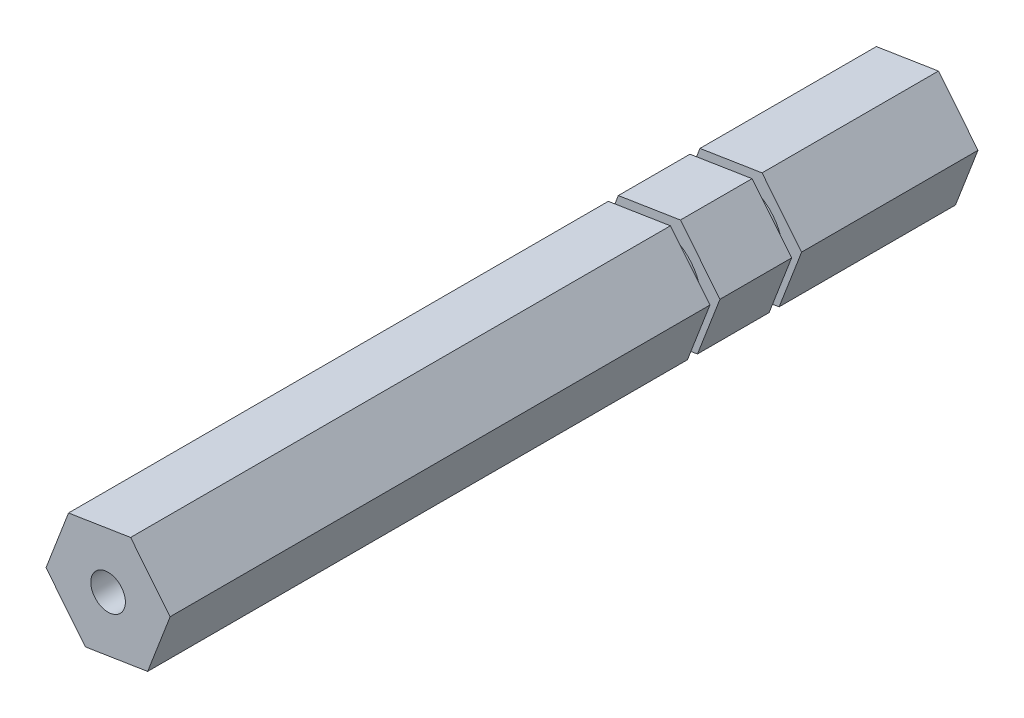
ISO-10303-21;
HEADER;
FILE_DESCRIPTION(('STEP AP214'),'2;1');
FILE_NAME('part.step','',(''),(''),'','','');
FILE_SCHEMA(('AUTOMOTIVE_DESIGN { 1 0 10303 214 1 1 1 1 }'));
ENDSEC;
DATA;
#1=APPLICATION_CONTEXT('core data for automotive mechanical design processes');
#2=APPLICATION_PROTOCOL_DEFINITION('international standard','automotive_design',2000,#1);
#3=PRODUCT_CONTEXT('',#1,'mechanical');
#4=PRODUCT('Part','Part','',(#3));
#5=PRODUCT_RELATED_PRODUCT_CATEGORY('part','',(#4));
#6=PRODUCT_DEFINITION_FORMATION('','',#4);
#7=PRODUCT_DEFINITION_CONTEXT('part definition',#1,'design');
#8=PRODUCT_DEFINITION('design','',#6,#7);
#9=PRODUCT_DEFINITION_SHAPE('','',#8);
#10=(LENGTH_UNIT() NAMED_UNIT(*) SI_UNIT(.MILLI.,.METRE.));
#11=(NAMED_UNIT(*) PLANE_ANGLE_UNIT() SI_UNIT($,.RADIAN.));
#12=(NAMED_UNIT(*) SI_UNIT($,.STERADIAN.) SOLID_ANGLE_UNIT());
#13=UNCERTAINTY_MEASURE_WITH_UNIT(LENGTH_MEASURE(1.E-05),#10,'distance_accuracy_value','');
#14=(GEOMETRIC_REPRESENTATION_CONTEXT(3) GLOBAL_UNCERTAINTY_ASSIGNED_CONTEXT((#13)) GLOBAL_UNIT_ASSIGNED_CONTEXT((#10,
#11,#12)) REPRESENTATION_CONTEXT('',''));
#15=CARTESIAN_POINT('',(0.,0.,0.));
#16=DIRECTION('',(0.,0.,1.));
#17=DIRECTION('',(1.,0.,0.));
#18=AXIS2_PLACEMENT_3D('',#15,#16,#17);
#19=CARTESIAN_POINT('',(7.24192768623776,1.14796198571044,94.234));
#20=DIRECTION('',(-0.777065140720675,-0.629420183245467,0.));
#21=DIRECTION('',(0.629420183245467,-0.777065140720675,0.));
#22=AXIS2_PLACEMENT_3D('',#19,#20,#21);
#23=PLANE('',#22);
#24=DIRECTION('',(0.,0.,-1.));
#25=VECTOR('',#24,1.);
#26=CARTESIAN_POINT('',(7.24192768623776,1.14796198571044,94.234));
#27=LINE('',#26,#25);
#28=CARTESIAN_POINT('',(7.24192768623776,1.14796198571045,30.099));
#29=VERTEX_POINT('',#28);
#30=CARTESIAN_POINT('',(7.24192768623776,1.14796198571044,21.7424));
#31=VERTEX_POINT('',#30);
#32=EDGE_CURVE('E307',#29,#31,#27,.T.);
#33=ORIENTED_EDGE('',*,*,#32,.T.);
#34=DIRECTION('',(-0.629420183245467,0.777065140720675,0.));
#35=VECTOR('',#34,1.);
#36=CARTESIAN_POINT('',(7.24192768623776,1.14796198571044,21.7424));
#37=LINE('',#36,#35);
#38=CARTESIAN_POINT('',(2.62679960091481,6.84567434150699,21.7424));
#39=VERTEX_POINT('',#38);
#40=EDGE_CURVE('E61',#31,#39,#37,.T.);
#41=ORIENTED_EDGE('',*,*,#40,.T.);
#42=DIRECTION('',(0.,0.,-1.));
#43=VECTOR('',#42,1.);
#44=CARTESIAN_POINT('',(2.62679960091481,6.84567434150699,94.234));
#45=LINE('',#44,#43);
#46=CARTESIAN_POINT('',(2.62679960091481,6.84567434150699,30.099));
#47=VERTEX_POINT('',#46);
#48=EDGE_CURVE('E332',#47,#39,#45,.T.);
#49=ORIENTED_EDGE('',*,*,#48,.F.);
#50=DIRECTION('',(0.629420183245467,-0.777065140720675,0.));
#51=VECTOR('',#50,1.);
#52=CARTESIAN_POINT('',(7.24192768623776,1.14796198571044,30.099));
#53=LINE('',#52,#51);
#54=EDGE_CURVE('E263',#47,#29,#53,.T.);
#55=ORIENTED_EDGE('',*,*,#54,.T.);
#56=EDGE_LOOP('',(#33,#41,#49,#55));
#57=FACE_BOUND('',#56,.T.);
#58=ADVANCED_FACE('F38',(#57),#23,.F.);
#59=CARTESIAN_POINT('',(2.62679960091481,6.84567434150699,94.234));
#60=DIRECTION('',(0.156561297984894,-0.987668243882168,0.));
#61=DIRECTION('',(0.987668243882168,0.156561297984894,0.));
#62=AXIS2_PLACEMENT_3D('',#59,#60,#61);
#63=PLANE('',#62);
#64=ORIENTED_EDGE('',*,*,#48,.T.);
#65=DIRECTION('',(-0.987668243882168,-0.156561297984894,0.));
#66=VECTOR('',#65,1.);
#67=CARTESIAN_POINT('',(2.62679960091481,6.84567434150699,21.7424));
#68=LINE('',#67,#66);
#69=CARTESIAN_POINT('',(-4.61512808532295,5.69771235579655,21.7424));
#70=VERTEX_POINT('',#69);
#71=EDGE_CURVE('E226',#39,#70,#68,.T.);
#72=ORIENTED_EDGE('',*,*,#71,.T.);
#73=DIRECTION('',(0.,0.,-1.));
#74=VECTOR('',#73,1.);
#75=CARTESIAN_POINT('',(-4.61512808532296,5.69771235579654,94.234));
#76=LINE('',#75,#74);
#77=CARTESIAN_POINT('',(-4.61512808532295,5.69771235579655,30.099));
#78=VERTEX_POINT('',#77);
#79=EDGE_CURVE('E327',#78,#70,#76,.T.);
#80=ORIENTED_EDGE('',*,*,#79,.F.);
#81=DIRECTION('',(0.987668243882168,0.156561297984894,0.));
#82=VECTOR('',#81,1.);
#83=CARTESIAN_POINT('',(2.62679960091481,6.84567434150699,30.099));
#84=LINE('',#83,#82);
#85=EDGE_CURVE('E260',#78,#47,#84,.T.);
#86=ORIENTED_EDGE('',*,*,#85,.T.);
#87=EDGE_LOOP('',(#64,#72,#80,#86));
#88=FACE_BOUND('',#87,.T.);
#89=ADVANCED_FACE('F387',(#88),#63,.F.);
#90=CARTESIAN_POINT('',(-4.61512808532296,5.69771235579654,94.234));
#91=DIRECTION('',(0.933626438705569,-0.3582480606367,0.));
#92=DIRECTION('',(0.3582480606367,0.933626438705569,0.));
#93=AXIS2_PLACEMENT_3D('',#90,#91,#92);
#94=PLANE('',#93);
#95=ORIENTED_EDGE('',*,*,#79,.T.);
#96=DIRECTION('',(-0.3582480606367,-0.933626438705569,0.));
#97=VECTOR('',#96,1.);
#98=CARTESIAN_POINT('',(-4.61512808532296,5.69771235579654,21.7424));
#99=LINE('',#98,#97);
#100=CARTESIAN_POINT('',(-7.24192768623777,-1.14796198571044,21.7424));
#101=VERTEX_POINT('',#100);
#102=EDGE_CURVE('E223',#70,#101,#99,.T.);
#103=ORIENTED_EDGE('',*,*,#102,.T.);
#104=DIRECTION('',(0.,0.,-1.));
#105=VECTOR('',#104,1.);
#106=CARTESIAN_POINT('',(-7.24192768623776,-1.14796198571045,94.234));
#107=LINE('',#106,#105);
#108=CARTESIAN_POINT('',(-7.24192768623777,-1.14796198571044,30.099));
#109=VERTEX_POINT('',#108);
#110=EDGE_CURVE('E322',#109,#101,#107,.T.);
#111=ORIENTED_EDGE('',*,*,#110,.F.);
#112=DIRECTION('',(0.3582480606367,0.933626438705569,0.));
#113=VECTOR('',#112,1.);
#114=CARTESIAN_POINT('',(-4.61512808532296,5.69771235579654,30.099));
#115=LINE('',#114,#113);
#116=EDGE_CURVE('E257',#109,#78,#115,.T.);
#117=ORIENTED_EDGE('',*,*,#116,.T.);
#118=EDGE_LOOP('',(#95,#103,#111,#117));
#119=FACE_BOUND('',#118,.T.);
#120=ADVANCED_FACE('F391',(#119),#94,.F.);
#121=CARTESIAN_POINT('',(-7.24192768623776,-1.14796198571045,94.234));
#122=DIRECTION('',(0.777065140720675,0.629420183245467,0.));
#123=DIRECTION('',(-0.629420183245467,0.777065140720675,0.));
#124=AXIS2_PLACEMENT_3D('',#121,#122,#123);
#125=PLANE('',#124);
#126=ORIENTED_EDGE('',*,*,#110,.T.);
#127=DIRECTION('',(0.629420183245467,-0.777065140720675,0.));
#128=VECTOR('',#127,1.);
#129=CARTESIAN_POINT('',(-7.24192768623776,-1.14796198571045,21.7424));
#130=LINE('',#129,#128);
#131=CARTESIAN_POINT('',(-2.62679960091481,-6.84567434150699,21.7424));
#132=VERTEX_POINT('',#131);
#133=EDGE_CURVE('E220',#101,#132,#130,.T.);
#134=ORIENTED_EDGE('',*,*,#133,.T.);
#135=DIRECTION('',(0.,0.,-1.));
#136=VECTOR('',#135,1.);
#137=CARTESIAN_POINT('',(-2.62679960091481,-6.84567434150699,94.234));
#138=LINE('',#137,#136);
#139=CARTESIAN_POINT('',(-2.62679960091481,-6.84567434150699,30.099));
#140=VERTEX_POINT('',#139);
#141=EDGE_CURVE('E317',#140,#132,#138,.T.);
#142=ORIENTED_EDGE('',*,*,#141,.F.);
#143=DIRECTION('',(-0.629420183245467,0.777065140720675,0.));
#144=VECTOR('',#143,1.);
#145=CARTESIAN_POINT('',(-7.24192768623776,-1.14796198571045,30.099));
#146=LINE('',#145,#144);
#147=EDGE_CURVE('E254',#140,#109,#146,.T.);
#148=ORIENTED_EDGE('',*,*,#147,.T.);
#149=EDGE_LOOP('',(#126,#134,#142,#148));
#150=FACE_BOUND('',#149,.T.);
#151=ADVANCED_FACE('F360',(#150),#125,.F.);
#152=CARTESIAN_POINT('',(-2.62679960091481,-6.84567434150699,94.234));
#153=DIRECTION('',(-0.156561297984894,0.987668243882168,0.));
#154=DIRECTION('',(-0.987668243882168,-0.156561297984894,0.));
#155=AXIS2_PLACEMENT_3D('',#152,#153,#154);
#156=PLANE('',#155);
#157=ORIENTED_EDGE('',*,*,#141,.T.);
#158=DIRECTION('',(0.987668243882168,0.156561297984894,0.));
#159=VECTOR('',#158,1.);
#160=CARTESIAN_POINT('',(-2.62679960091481,-6.84567434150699,21.7424));
#161=LINE('',#160,#159);
#162=CARTESIAN_POINT('',(4.61512808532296,-5.69771235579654,21.7424));
#163=VERTEX_POINT('',#162);
#164=EDGE_CURVE('E217',#132,#163,#161,.T.);
#165=ORIENTED_EDGE('',*,*,#164,.T.);
#166=DIRECTION('',(0.,0.,-1.));
#167=VECTOR('',#166,1.);
#168=CARTESIAN_POINT('',(4.61512808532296,-5.69771235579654,94.234));
#169=LINE('',#168,#167);
#170=CARTESIAN_POINT('',(4.61512808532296,-5.69771235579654,30.099));
#171=VERTEX_POINT('',#170);
#172=EDGE_CURVE('E312',#171,#163,#169,.T.);
#173=ORIENTED_EDGE('',*,*,#172,.F.);
#174=DIRECTION('',(-0.987668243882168,-0.156561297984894,0.));
#175=VECTOR('',#174,1.);
#176=CARTESIAN_POINT('',(-2.62679960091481,-6.84567434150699,30.099));
#177=LINE('',#176,#175);
#178=EDGE_CURVE('E251',#171,#140,#177,.T.);
#179=ORIENTED_EDGE('',*,*,#178,.T.);
#180=EDGE_LOOP('',(#157,#165,#173,#179));
#181=FACE_BOUND('',#180,.T.);
#182=ADVANCED_FACE('F355',(#181),#156,.F.);
#183=CARTESIAN_POINT('',(4.61512808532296,-5.69771235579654,94.234));
#184=DIRECTION('',(-0.933626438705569,0.358248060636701,0.));
#185=DIRECTION('',(-0.358248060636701,-0.933626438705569,0.));
#186=AXIS2_PLACEMENT_3D('',#183,#184,#185);
#187=PLANE('',#186);
#188=ORIENTED_EDGE('',*,*,#172,.T.);
#189=DIRECTION('',(0.358248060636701,0.933626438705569,0.));
#190=VECTOR('',#189,1.);
#191=CARTESIAN_POINT('',(4.61512808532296,-5.69771235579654,21.7424));
#192=LINE('',#191,#190);
#193=EDGE_CURVE('E11',#163,#31,#192,.T.);
#194=ORIENTED_EDGE('',*,*,#193,.T.);
#195=ORIENTED_EDGE('',*,*,#32,.F.);
#196=DIRECTION('',(-0.358248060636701,-0.933626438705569,0.));
#197=VECTOR('',#196,1.);
#198=CARTESIAN_POINT('',(4.61512808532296,-5.69771235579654,30.099));
#199=LINE('',#198,#197);
#200=EDGE_CURVE('E335',#29,#171,#199,.T.);
#201=ORIENTED_EDGE('',*,*,#200,.T.);
#202=EDGE_LOOP('',(#188,#194,#195,#201));
#203=FACE_BOUND('',#202,.T.);
#204=ADVANCED_FACE('F350',(#203),#187,.F.);
#205=CARTESIAN_POINT('',(-4.61512808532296,5.69771235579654,30.099));
#206=DIRECTION('',(0.,0.,-1.));
#207=DIRECTION('',(-1.,0.,0.));
#208=AXIS2_PLACEMENT_3D('',#205,#206,#207);
#209=PLANE('',#208);
#210=CARTESIAN_POINT('',(0.,0.,30.099));
#211=DIRECTION('',(0.,0.,-1.));
#212=DIRECTION('',(-1.,0.,0.));
#213=AXIS2_PLACEMENT_3D('',#210,#211,#212);
#214=CIRCLE('',#213,5.02919999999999);
#215=CARTESIAN_POINT('',(-5.02919999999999,0.,30.099));
#216=VERTEX_POINT('',#215);
#217=EDGE_CURVE('E230',#216,#216,#214,.T.);
#218=ORIENTED_EDGE('',*,*,#217,.T.);
#219=EDGE_LOOP('',(#218));
#220=FACE_BOUND('',#219,.T.);
#221=ORIENTED_EDGE('',*,*,#85,.F.);
#222=ORIENTED_EDGE('',*,*,#116,.F.);
#223=ORIENTED_EDGE('',*,*,#147,.F.);
#224=ORIENTED_EDGE('',*,*,#178,.F.);
#225=ORIENTED_EDGE('',*,*,#200,.F.);
#226=ORIENTED_EDGE('',*,*,#54,.F.);
#227=EDGE_LOOP('',(#221,#222,#223,#224,#225,#226));
#228=FACE_BOUND('',#227,.T.);
#229=ADVANCED_FACE('F384',(#220,#228),#209,.F.);
#230=CARTESIAN_POINT('',(-4.61512808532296,5.69771235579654,31.2674));
#231=DIRECTION('',(0.,0.,1.));
#232=DIRECTION('',(1.,0.,0.));
#233=AXIS2_PLACEMENT_3D('',#230,#231,#232);
#234=PLANE('',#233);
#235=CARTESIAN_POINT('',(0.,0.,31.2674));
#236=DIRECTION('',(0.,0.,-1.));
#237=DIRECTION('',(-1.,0.,0.));
#238=AXIS2_PLACEMENT_3D('',#235,#236,#237);
#239=CIRCLE('',#238,5.02919999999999);
#240=CARTESIAN_POINT('',(-5.02919999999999,0.,31.2674));
#241=VERTEX_POINT('',#240);
#242=EDGE_CURVE('E233',#241,#241,#239,.T.);
#243=ORIENTED_EDGE('',*,*,#242,.F.);
#244=EDGE_LOOP('',(#243));
#245=FACE_BOUND('',#244,.T.);
#246=DIRECTION('',(0.358248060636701,0.933626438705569,0.));
#247=VECTOR('',#246,1.);
#248=CARTESIAN_POINT('',(4.61512808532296,-5.69771235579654,31.2674));
#249=LINE('',#248,#247);
#250=CARTESIAN_POINT('',(4.61512808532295,-5.69771235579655,31.2674));
#251=VERTEX_POINT('',#250);
#252=CARTESIAN_POINT('',(7.24192768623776,1.14796198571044,31.2674));
#253=VERTEX_POINT('',#252);
#254=EDGE_CURVE('E331',#251,#253,#249,.T.);
#255=ORIENTED_EDGE('',*,*,#254,.F.);
#256=DIRECTION('',(0.987668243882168,0.156561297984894,0.));
#257=VECTOR('',#256,1.);
#258=CARTESIAN_POINT('',(-2.62679960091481,-6.84567434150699,31.2674));
#259=LINE('',#258,#257);
#260=CARTESIAN_POINT('',(-2.62679960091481,-6.84567434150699,31.2674));
#261=VERTEX_POINT('',#260);
#262=EDGE_CURVE('E236',#261,#251,#259,.T.);
#263=ORIENTED_EDGE('',*,*,#262,.F.);
#264=DIRECTION('',(0.629420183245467,-0.777065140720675,0.));
#265=VECTOR('',#264,1.);
#266=CARTESIAN_POINT('',(-7.24192768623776,-1.14796198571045,31.2674));
#267=LINE('',#266,#265);
#268=CARTESIAN_POINT('',(-7.24192768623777,-1.14796198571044,31.2674));
#269=VERTEX_POINT('',#268);
#270=EDGE_CURVE('E239',#269,#261,#267,.T.);
#271=ORIENTED_EDGE('',*,*,#270,.F.);
#272=DIRECTION('',(-0.3582480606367,-0.933626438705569,0.));
#273=VECTOR('',#272,1.);
#274=CARTESIAN_POINT('',(-4.61512808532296,5.69771235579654,31.2674));
#275=LINE('',#274,#273);
#276=CARTESIAN_POINT('',(-4.61512808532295,5.69771235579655,31.2674));
#277=VERTEX_POINT('',#276);
#278=EDGE_CURVE('E242',#277,#269,#275,.T.);
#279=ORIENTED_EDGE('',*,*,#278,.F.);
#280=DIRECTION('',(-0.987668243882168,-0.156561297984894,0.));
#281=VECTOR('',#280,1.);
#282=CARTESIAN_POINT('',(2.62679960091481,6.84567434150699,31.2674));
#283=LINE('',#282,#281);
#284=CARTESIAN_POINT('',(2.62679960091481,6.84567434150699,31.2674));
#285=VERTEX_POINT('',#284);
#286=EDGE_CURVE('E245',#285,#277,#283,.T.);
#287=ORIENTED_EDGE('',*,*,#286,.F.);
#288=DIRECTION('',(-0.629420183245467,0.777065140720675,0.));
#289=VECTOR('',#288,1.);
#290=CARTESIAN_POINT('',(7.24192768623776,1.14796198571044,31.2674));
#291=LINE('',#290,#289);
#292=EDGE_CURVE('E248',#253,#285,#291,.T.);
#293=ORIENTED_EDGE('',*,*,#292,.F.);
#294=EDGE_LOOP('',(#255,#263,#271,#279,#287,#293));
#295=FACE_BOUND('',#294,.T.);
#296=ADVANCED_FACE('F429',(#245,#295),#234,.F.);
#297=CARTESIAN_POINT('',(0.,0.,0.));
#298=DIRECTION('',(0.,0.,-1.));
#299=DIRECTION('',(-1.,0.,0.));
#300=AXIS2_PLACEMENT_3D('',#297,#298,#299);
#301=CYLINDRICAL_SURFACE('',#300,5.02919999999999);
#302=ORIENTED_EDGE('',*,*,#217,.F.);
#303=EDGE_LOOP('',(#302));
#304=FACE_BOUND('',#303,.T.);
#305=ORIENTED_EDGE('',*,*,#242,.T.);
#306=EDGE_LOOP('',(#305));
#307=FACE_BOUND('',#306,.T.);
#308=ADVANCED_FACE('F442',(#304,#307),#301,.T.);
#309=CARTESIAN_POINT('',(0.,0.,94.234));
#310=DIRECTION('',(0.,0.,1.));
#311=DIRECTION('',(1.,0.,0.));
#312=AXIS2_PLACEMENT_3D('',#309,#310,#311);
#313=PLANE('',#312);
#314=CARTESIAN_POINT('',(0.,0.,94.234));
#315=DIRECTION('',(0.,0.,1.));
#316=DIRECTION('',(1.,0.,0.));
#317=AXIS2_PLACEMENT_3D('',#314,#315,#316);
#318=CIRCLE('',#317,2.01929999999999);
#319=CARTESIAN_POINT('',(2.01929999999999,0.,94.234));
#320=VERTEX_POINT('',#319);
#321=EDGE_CURVE('E184',#320,#320,#318,.T.);
#322=ORIENTED_EDGE('',*,*,#321,.F.);
#323=EDGE_LOOP('',(#322));
#324=FACE_BOUND('',#323,.T.);
#325=DIRECTION('',(-0.629420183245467,0.777065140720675,0.));
#326=VECTOR('',#325,1.);
#327=CARTESIAN_POINT('',(7.24192768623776,1.14796198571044,94.234));
#328=LINE('',#327,#326);
#329=CARTESIAN_POINT('',(7.24192768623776,1.14796198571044,94.234));
#330=VERTEX_POINT('',#329);
#331=CARTESIAN_POINT('',(2.62679960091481,6.84567434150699,94.234));
#332=VERTEX_POINT('',#331);
#333=EDGE_CURVE('E267',#330,#332,#328,.T.);
#334=ORIENTED_EDGE('',*,*,#333,.T.);
#335=DIRECTION('',(-0.987668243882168,-0.156561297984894,0.));
#336=VECTOR('',#335,1.);
#337=CARTESIAN_POINT('',(2.62679960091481,6.84567434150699,94.234));
#338=LINE('',#337,#336);
#339=CARTESIAN_POINT('',(-4.61512808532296,5.69771235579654,94.234));
#340=VERTEX_POINT('',#339);
#341=EDGE_CURVE('E270',#332,#340,#338,.T.);
#342=ORIENTED_EDGE('',*,*,#341,.T.);
#343=DIRECTION('',(-0.3582480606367,-0.933626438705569,0.));
#344=VECTOR('',#343,1.);
#345=CARTESIAN_POINT('',(-4.61512808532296,5.69771235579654,94.234));
#346=LINE('',#345,#344);
#347=CARTESIAN_POINT('',(-7.24192768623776,-1.14796198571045,94.234));
#348=VERTEX_POINT('',#347);
#349=EDGE_CURVE('E273',#340,#348,#346,.T.);
#350=ORIENTED_EDGE('',*,*,#349,.T.);
#351=DIRECTION('',(0.629420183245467,-0.777065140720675,0.));
#352=VECTOR('',#351,1.);
#353=CARTESIAN_POINT('',(-7.24192768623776,-1.14796198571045,94.234));
#354=LINE('',#353,#352);
#355=CARTESIAN_POINT('',(-2.62679960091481,-6.84567434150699,94.234));
#356=VERTEX_POINT('',#355);
#357=EDGE_CURVE('E275',#348,#356,#354,.T.);
#358=ORIENTED_EDGE('',*,*,#357,.T.);
#359=DIRECTION('',(0.987668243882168,0.156561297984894,0.));
#360=VECTOR('',#359,1.);
#361=CARTESIAN_POINT('',(-2.62679960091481,-6.84567434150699,94.234));
#362=LINE('',#361,#360);
#363=CARTESIAN_POINT('',(4.61512808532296,-5.69771235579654,94.234));
#364=VERTEX_POINT('',#363);
#365=EDGE_CURVE('E277',#356,#364,#362,.T.);
#366=ORIENTED_EDGE('',*,*,#365,.T.);
#367=DIRECTION('',(0.358248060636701,0.933626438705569,0.));
#368=VECTOR('',#367,1.);
#369=CARTESIAN_POINT('',(4.61512808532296,-5.69771235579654,94.234));
#370=LINE('',#369,#368);
#371=EDGE_CURVE('E279',#364,#330,#370,.T.);
#372=ORIENTED_EDGE('',*,*,#371,.T.);
#373=EDGE_LOOP('',(#334,#342,#350,#358,#366,#372));
#374=FACE_BOUND('',#373,.T.);
#375=ADVANCED_FACE('F440',(#324,#374),#313,.T.);
#376=EDGE_CURVE('E308',#364,#251,#169,.T.);
#377=ORIENTED_EDGE('',*,*,#376,.T.);
#378=ORIENTED_EDGE('',*,*,#254,.T.);
#379=EDGE_CURVE('E303',#330,#253,#27,.T.);
#380=ORIENTED_EDGE('',*,*,#379,.F.);
#381=ORIENTED_EDGE('',*,*,#371,.F.);
#382=EDGE_LOOP('',(#377,#378,#380,#381));
#383=FACE_BOUND('',#382,.T.);
#384=ADVANCED_FACE('F426',(#383),#187,.F.);
#385=EDGE_CURVE('E313',#356,#261,#138,.T.);
#386=ORIENTED_EDGE('',*,*,#385,.T.);
#387=ORIENTED_EDGE('',*,*,#262,.T.);
#388=ORIENTED_EDGE('',*,*,#376,.F.);
#389=ORIENTED_EDGE('',*,*,#365,.F.);
#390=EDGE_LOOP('',(#386,#387,#388,#389));
#391=FACE_BOUND('',#390,.T.);
#392=ADVANCED_FACE('F431',(#391),#156,.F.);
#393=EDGE_CURVE('E318',#348,#269,#107,.T.);
#394=ORIENTED_EDGE('',*,*,#393,.T.);
#395=ORIENTED_EDGE('',*,*,#270,.T.);
#396=ORIENTED_EDGE('',*,*,#385,.F.);
#397=ORIENTED_EDGE('',*,*,#357,.F.);
#398=EDGE_LOOP('',(#394,#395,#396,#397));
#399=FACE_BOUND('',#398,.T.);
#400=ADVANCED_FACE('F400',(#399),#125,.F.);
#401=EDGE_CURVE('E323',#340,#277,#76,.T.);
#402=ORIENTED_EDGE('',*,*,#401,.T.);
#403=ORIENTED_EDGE('',*,*,#278,.T.);
#404=ORIENTED_EDGE('',*,*,#393,.F.);
#405=ORIENTED_EDGE('',*,*,#349,.F.);
#406=EDGE_LOOP('',(#402,#403,#404,#405));
#407=FACE_BOUND('',#406,.T.);
#408=ADVANCED_FACE('F394',(#407),#94,.F.);
#409=EDGE_CURVE('E328',#332,#285,#45,.T.);
#410=ORIENTED_EDGE('',*,*,#409,.T.);
#411=ORIENTED_EDGE('',*,*,#286,.T.);
#412=ORIENTED_EDGE('',*,*,#401,.F.);
#413=ORIENTED_EDGE('',*,*,#341,.F.);
#414=EDGE_LOOP('',(#410,#411,#412,#413));
#415=FACE_BOUND('',#414,.T.);
#416=ADVANCED_FACE('F402',(#415),#63,.F.);
#417=ORIENTED_EDGE('',*,*,#379,.T.);
#418=ORIENTED_EDGE('',*,*,#292,.T.);
#419=ORIENTED_EDGE('',*,*,#409,.F.);
#420=ORIENTED_EDGE('',*,*,#333,.F.);
#421=EDGE_LOOP('',(#417,#418,#419,#420));
#422=FACE_BOUND('',#421,.T.);
#423=ADVANCED_FACE('F40',(#422),#23,.F.);
#424=CARTESIAN_POINT('',(-4.61512808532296,5.69771235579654,21.7424));
#425=DIRECTION('',(0.,0.,1.));
#426=DIRECTION('',(1.,0.,0.));
#427=AXIS2_PLACEMENT_3D('',#424,#425,#426);
#428=PLANE('',#427);
#429=CARTESIAN_POINT('',(0.,0.,21.7424));
#430=DIRECTION('',(0.,0.,-1.));
#431=DIRECTION('',(-1.,0.,0.));
#432=AXIS2_PLACEMENT_3D('',#429,#430,#431);
#433=CIRCLE('',#432,5.0292);
#434=CARTESIAN_POINT('',(-5.0292,0.,21.7424));
#435=VERTEX_POINT('',#434);
#436=EDGE_CURVE('E201',#435,#435,#433,.T.);
#437=ORIENTED_EDGE('',*,*,#436,.F.);
#438=EDGE_LOOP('',(#437));
#439=FACE_BOUND('',#438,.T.);
#440=ORIENTED_EDGE('',*,*,#193,.F.);
#441=ORIENTED_EDGE('',*,*,#164,.F.);
#442=ORIENTED_EDGE('',*,*,#133,.F.);
#443=ORIENTED_EDGE('',*,*,#102,.F.);
#444=ORIENTED_EDGE('',*,*,#71,.F.);
#445=ORIENTED_EDGE('',*,*,#40,.F.);
#446=EDGE_LOOP('',(#440,#441,#442,#443,#444,#445));
#447=FACE_BOUND('',#446,.T.);
#448=ADVANCED_FACE('F357',(#439,#447),#428,.F.);
#449=CARTESIAN_POINT('',(-4.61512808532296,5.69771235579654,20.574));
#450=DIRECTION('',(0.,0.,-1.));
#451=DIRECTION('',(-1.,0.,0.));
#452=AXIS2_PLACEMENT_3D('',#449,#450,#451);
#453=PLANE('',#452);
#454=CARTESIAN_POINT('',(0.,0.,20.574));
#455=DIRECTION('',(0.,0.,-1.));
#456=DIRECTION('',(-1.,0.,0.));
#457=AXIS2_PLACEMENT_3D('',#454,#455,#456);
#458=CIRCLE('',#457,5.0292);
#459=CARTESIAN_POINT('',(-5.0292,0.,20.574));
#460=VERTEX_POINT('',#459);
#461=EDGE_CURVE('E198',#460,#460,#458,.T.);
#462=ORIENTED_EDGE('',*,*,#461,.T.);
#463=EDGE_LOOP('',(#462));
#464=FACE_BOUND('',#463,.T.);
#465=DIRECTION('',(0.987668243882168,0.156561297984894,0.));
#466=VECTOR('',#465,1.);
#467=CARTESIAN_POINT('',(2.62679960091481,6.84567434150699,20.574));
#468=LINE('',#467,#466);
#469=CARTESIAN_POINT('',(-4.61512808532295,5.69771235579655,20.574));
#470=VERTEX_POINT('',#469);
#471=CARTESIAN_POINT('',(2.62679960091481,6.84567434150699,20.574));
#472=VERTEX_POINT('',#471);
#473=EDGE_CURVE('E211',#470,#472,#468,.T.);
#474=ORIENTED_EDGE('',*,*,#473,.F.);
#475=DIRECTION('',(0.3582480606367,0.933626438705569,0.));
#476=VECTOR('',#475,1.);
#477=CARTESIAN_POINT('',(-4.61512808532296,5.69771235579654,20.574));
#478=LINE('',#477,#476);
#479=CARTESIAN_POINT('',(-7.24192768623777,-1.14796198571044,20.574));
#480=VERTEX_POINT('',#479);
#481=EDGE_CURVE('E208',#480,#470,#478,.T.);
#482=ORIENTED_EDGE('',*,*,#481,.F.);
#483=DIRECTION('',(-0.629420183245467,0.777065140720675,0.));
#484=VECTOR('',#483,1.);
#485=CARTESIAN_POINT('',(-7.24192768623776,-1.14796198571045,20.574));
#486=LINE('',#485,#484);
#487=CARTESIAN_POINT('',(-2.62679960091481,-6.84567434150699,20.574));
#488=VERTEX_POINT('',#487);
#489=EDGE_CURVE('E205',#488,#480,#486,.T.);
#490=ORIENTED_EDGE('',*,*,#489,.F.);
#491=DIRECTION('',(-0.987668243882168,-0.156561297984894,0.));
#492=VECTOR('',#491,1.);
#493=CARTESIAN_POINT('',(-2.62679960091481,-6.84567434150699,20.574));
#494=LINE('',#493,#492);
#495=CARTESIAN_POINT('',(4.61512808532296,-5.69771235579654,20.574));
#496=VERTEX_POINT('',#495);
#497=EDGE_CURVE('E53',#496,#488,#494,.T.);
#498=ORIENTED_EDGE('',*,*,#497,.F.);
#499=DIRECTION('',(-0.358248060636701,-0.933626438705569,0.));
#500=VECTOR('',#499,1.);
#501=CARTESIAN_POINT('',(4.61512808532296,-5.69771235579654,20.574));
#502=LINE('',#501,#500);
#503=CARTESIAN_POINT('',(7.24192768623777,1.14796198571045,20.574));
#504=VERTEX_POINT('',#503);
#505=EDGE_CURVE('E46',#504,#496,#502,.T.);
#506=ORIENTED_EDGE('',*,*,#505,.F.);
#507=DIRECTION('',(0.629420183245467,-0.777065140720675,0.));
#508=VECTOR('',#507,1.);
#509=CARTESIAN_POINT('',(7.24192768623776,1.14796198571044,20.574));
#510=LINE('',#509,#508);
#511=EDGE_CURVE('E214',#472,#504,#510,.T.);
#512=ORIENTED_EDGE('',*,*,#511,.F.);
#513=EDGE_LOOP('',(#474,#482,#490,#498,#506,#512));
#514=FACE_BOUND('',#513,.T.);
#515=ADVANCED_FACE('F417',(#464,#514),#453,.F.);
#516=CARTESIAN_POINT('',(0.,0.,0.));
#517=DIRECTION('',(0.,0.,-1.));
#518=DIRECTION('',(-1.,0.,0.));
#519=AXIS2_PLACEMENT_3D('',#516,#517,#518);
#520=CYLINDRICAL_SURFACE('',#519,5.0292);
#521=ORIENTED_EDGE('',*,*,#461,.F.);
#522=EDGE_LOOP('',(#521));
#523=FACE_BOUND('',#522,.T.);
#524=ORIENTED_EDGE('',*,*,#436,.T.);
#525=EDGE_LOOP('',(#524));
#526=FACE_BOUND('',#525,.T.);
#527=ADVANCED_FACE('F457',(#523,#526),#520,.T.);
#528=CARTESIAN_POINT('',(0.,0.,0.));
#529=DIRECTION('',(0.,0.,1.));
#530=DIRECTION('',(1.,0.,0.));
#531=AXIS2_PLACEMENT_3D('',#528,#529,#530);
#532=PLANE('',#531);
#533=CARTESIAN_POINT('',(0.,0.,0.));
#534=DIRECTION('',(0.,0.,-1.));
#535=DIRECTION('',(-1.,0.,0.));
#536=AXIS2_PLACEMENT_3D('',#533,#534,#535);
#537=CIRCLE('',#536,2.01929999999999);
#538=CARTESIAN_POINT('',(-2.01929999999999,0.,0.));
#539=VERTEX_POINT('',#538);
#540=EDGE_CURVE('E185',#539,#539,#537,.T.);
#541=ORIENTED_EDGE('',*,*,#540,.F.);
#542=EDGE_LOOP('',(#541));
#543=FACE_BOUND('',#542,.T.);
#544=DIRECTION('',(-0.629420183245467,0.777065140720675,0.));
#545=VECTOR('',#544,1.);
#546=CARTESIAN_POINT('',(7.24192768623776,1.14796198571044,0.));
#547=LINE('',#546,#545);
#548=CARTESIAN_POINT('',(7.24192768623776,1.14796198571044,0.));
#549=VERTEX_POINT('',#548);
#550=CARTESIAN_POINT('',(2.62679960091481,6.84567434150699,0.));
#551=VERTEX_POINT('',#550);
#552=EDGE_CURVE('E266',#549,#551,#547,.T.);
#553=ORIENTED_EDGE('',*,*,#552,.F.);
#554=DIRECTION('',(0.358248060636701,0.933626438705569,0.));
#555=VECTOR('',#554,1.);
#556=CARTESIAN_POINT('',(4.61512808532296,-5.69771235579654,0.));
#557=LINE('',#556,#555);
#558=CARTESIAN_POINT('',(4.61512808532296,-5.69771235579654,0.));
#559=VERTEX_POINT('',#558);
#560=EDGE_CURVE('E271',#559,#549,#557,.T.);
#561=ORIENTED_EDGE('',*,*,#560,.F.);
#562=DIRECTION('',(0.987668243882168,0.156561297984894,0.));
#563=VECTOR('',#562,1.);
#564=CARTESIAN_POINT('',(-2.62679960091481,-6.84567434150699,0.));
#565=LINE('',#564,#563);
#566=CARTESIAN_POINT('',(-2.62679960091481,-6.84567434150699,0.));
#567=VERTEX_POINT('',#566);
#568=EDGE_CURVE('E296',#567,#559,#565,.T.);
#569=ORIENTED_EDGE('',*,*,#568,.F.);
#570=DIRECTION('',(0.629420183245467,-0.777065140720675,0.));
#571=VECTOR('',#570,1.);
#572=CARTESIAN_POINT('',(-7.24192768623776,-1.14796198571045,0.));
#573=LINE('',#572,#571);
#574=CARTESIAN_POINT('',(-7.24192768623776,-1.14796198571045,0.));
#575=VERTEX_POINT('',#574);
#576=EDGE_CURVE('E292',#575,#567,#573,.T.);
#577=ORIENTED_EDGE('',*,*,#576,.F.);
#578=DIRECTION('',(-0.3582480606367,-0.933626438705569,0.));
#579=VECTOR('',#578,1.);
#580=CARTESIAN_POINT('',(-4.61512808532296,5.69771235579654,0.));
#581=LINE('',#580,#579);
#582=CARTESIAN_POINT('',(-4.61512808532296,5.69771235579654,0.));
#583=VERTEX_POINT('',#582);
#584=EDGE_CURVE('E288',#583,#575,#581,.T.);
#585=ORIENTED_EDGE('',*,*,#584,.F.);
#586=DIRECTION('',(-0.987668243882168,-0.156561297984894,0.));
#587=VECTOR('',#586,1.);
#588=CARTESIAN_POINT('',(2.62679960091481,6.84567434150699,0.));
#589=LINE('',#588,#587);
#590=EDGE_CURVE('E284',#551,#583,#589,.T.);
#591=ORIENTED_EDGE('',*,*,#590,.F.);
#592=EDGE_LOOP('',(#553,#561,#569,#577,#585,#591));
#593=FACE_BOUND('',#592,.T.);
#594=ADVANCED_FACE('F375',(#543,#593),#532,.F.);
#595=EDGE_CURVE('E281',#504,#549,#27,.T.);
#596=ORIENTED_EDGE('',*,*,#595,.F.);
#597=ORIENTED_EDGE('',*,*,#505,.T.);
#598=EDGE_CURVE('E306',#496,#559,#169,.T.);
#599=ORIENTED_EDGE('',*,*,#598,.T.);
#600=ORIENTED_EDGE('',*,*,#560,.T.);
#601=EDGE_LOOP('',(#596,#597,#599,#600));
#602=FACE_BOUND('',#601,.T.);
#603=ADVANCED_FACE('F340',(#602),#187,.F.);
#604=ORIENTED_EDGE('',*,*,#598,.F.);
#605=ORIENTED_EDGE('',*,*,#497,.T.);
#606=EDGE_CURVE('E311',#488,#567,#138,.T.);
#607=ORIENTED_EDGE('',*,*,#606,.T.);
#608=ORIENTED_EDGE('',*,*,#568,.T.);
#609=EDGE_LOOP('',(#604,#605,#607,#608));
#610=FACE_BOUND('',#609,.T.);
#611=ADVANCED_FACE('F342',(#610),#156,.F.);
#612=ORIENTED_EDGE('',*,*,#606,.F.);
#613=ORIENTED_EDGE('',*,*,#489,.T.);
#614=EDGE_CURVE('E316',#480,#575,#107,.T.);
#615=ORIENTED_EDGE('',*,*,#614,.T.);
#616=ORIENTED_EDGE('',*,*,#576,.T.);
#617=EDGE_LOOP('',(#612,#613,#615,#616));
#618=FACE_BOUND('',#617,.T.);
#619=ADVANCED_FACE('F366',(#618),#125,.F.);
#620=ORIENTED_EDGE('',*,*,#614,.F.);
#621=ORIENTED_EDGE('',*,*,#481,.T.);
#622=EDGE_CURVE('E321',#470,#583,#76,.T.);
#623=ORIENTED_EDGE('',*,*,#622,.T.);
#624=ORIENTED_EDGE('',*,*,#584,.T.);
#625=EDGE_LOOP('',(#620,#621,#623,#624));
#626=FACE_BOUND('',#625,.T.);
#627=ADVANCED_FACE('F370',(#626),#94,.F.);
#628=ORIENTED_EDGE('',*,*,#622,.F.);
#629=ORIENTED_EDGE('',*,*,#473,.T.);
#630=EDGE_CURVE('E326',#472,#551,#45,.T.);
#631=ORIENTED_EDGE('',*,*,#630,.T.);
#632=ORIENTED_EDGE('',*,*,#590,.T.);
#633=EDGE_LOOP('',(#628,#629,#631,#632));
#634=FACE_BOUND('',#633,.T.);
#635=ADVANCED_FACE('F401',(#634),#63,.F.);
#636=ORIENTED_EDGE('',*,*,#630,.F.);
#637=ORIENTED_EDGE('',*,*,#511,.T.);
#638=ORIENTED_EDGE('',*,*,#595,.T.);
#639=ORIENTED_EDGE('',*,*,#552,.T.);
#640=EDGE_LOOP('',(#636,#637,#638,#639));
#641=FACE_BOUND('',#640,.T.);
#642=ADVANCED_FACE('F378',(#641),#23,.F.);
#643=CARTESIAN_POINT('',(0.,0.,81.534));
#644=DIRECTION('',(0.,0.,1.));
#645=DIRECTION('',(1.,0.,0.));
#646=AXIS2_PLACEMENT_3D('',#643,#644,#645);
#647=CONICAL_SURFACE('',#646,2.01929999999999,1.02974425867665);
#648=CARTESIAN_POINT('',(0.,0.,80.3206821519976));
#649=VERTEX_POINT('',#648);
#650=VERTEX_LOOP('',#649);
#651=FACE_BOUND('',#650,.T.);
#652=CARTESIAN_POINT('',(0.,0.,81.534));
#653=DIRECTION('',(0.,0.,1.));
#654=DIRECTION('',(1.,0.,0.));
#655=AXIS2_PLACEMENT_3D('',#652,#653,#654);
#656=CIRCLE('',#655,2.01929999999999);
#657=CARTESIAN_POINT('',(2.01929999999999,0.,81.534));
#658=VERTEX_POINT('',#657);
#659=EDGE_CURVE('E190',#658,#658,#656,.T.);
#660=ORIENTED_EDGE('',*,*,#659,.T.);
#661=EDGE_LOOP('',(#660));
#662=FACE_BOUND('',#661,.T.);
#663=ADVANCED_FACE('F410',(#651,#662),#647,.F.);
#664=CARTESIAN_POINT('',(0.,0.,94.234));
#665=DIRECTION('',(0.,0.,1.));
#666=DIRECTION('',(1.,0.,0.));
#667=AXIS2_PLACEMENT_3D('',#664,#665,#666);
#668=CYLINDRICAL_SURFACE('',#667,2.01929999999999);
#669=ORIENTED_EDGE('',*,*,#659,.F.);
#670=EDGE_LOOP('',(#669));
#671=FACE_BOUND('',#670,.T.);
#672=ORIENTED_EDGE('',*,*,#321,.T.);
#673=EDGE_LOOP('',(#672));
#674=FACE_BOUND('',#673,.T.);
#675=ADVANCED_FACE('F177',(#671,#674),#668,.F.);
#676=CARTESIAN_POINT('',(0.,0.,12.7));
#677=DIRECTION('',(0.,0.,-1.));
#678=DIRECTION('',(-1.,0.,0.));
#679=AXIS2_PLACEMENT_3D('',#676,#677,#678);
#680=CONICAL_SURFACE('',#679,2.01929999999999,1.02974425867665);
#681=CARTESIAN_POINT('',(0.,0.,13.9133178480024));
#682=VERTEX_POINT('',#681);
#683=VERTEX_LOOP('',#682);
#684=FACE_BOUND('',#683,.T.);
#685=CARTESIAN_POINT('',(0.,0.,12.7));
#686=DIRECTION('',(0.,0.,-1.));
#687=DIRECTION('',(-1.,0.,0.));
#688=AXIS2_PLACEMENT_3D('',#685,#686,#687);
#689=CIRCLE('',#688,2.01929999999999);
#690=CARTESIAN_POINT('',(-2.01929999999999,0.,12.7));
#691=VERTEX_POINT('',#690);
#692=EDGE_CURVE('E181',#691,#691,#689,.T.);
#693=ORIENTED_EDGE('',*,*,#692,.T.);
#694=EDGE_LOOP('',(#693));
#695=FACE_BOUND('',#694,.T.);
#696=ADVANCED_FACE('F173',(#684,#695),#680,.F.);
#697=CARTESIAN_POINT('',(0.,0.,0.));
#698=DIRECTION('',(0.,0.,-1.));
#699=DIRECTION('',(-1.,0.,0.));
#700=AXIS2_PLACEMENT_3D('',#697,#698,#699);
#701=CYLINDRICAL_SURFACE('',#700,2.01929999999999);
#702=ORIENTED_EDGE('',*,*,#692,.F.);
#703=EDGE_LOOP('',(#702));
#704=FACE_BOUND('',#703,.T.);
#705=ORIENTED_EDGE('',*,*,#540,.T.);
#706=EDGE_LOOP('',(#705));
#707=FACE_BOUND('',#706,.T.);
#708=ADVANCED_FACE('F176',(#704,#707),#701,.F.);
#709=CLOSED_SHELL('',(#58,#89,#120,#151,#182,#204,#229,#296,#308,#375,#384,#392,#400,#408,#416,
#423,#448,#515,#527,#594,#603,#611,#619,#627,#635,#642,#663,#675,#696,#708));
#710=MANIFOLD_SOLID_BREP('B2',#709);
#711=ADVANCED_BREP_SHAPE_REPRESENTATION('',(#18,#710),#14);
#712=SHAPE_DEFINITION_REPRESENTATION(#9,#711);
ENDSEC;
END-ISO-10303-21;
